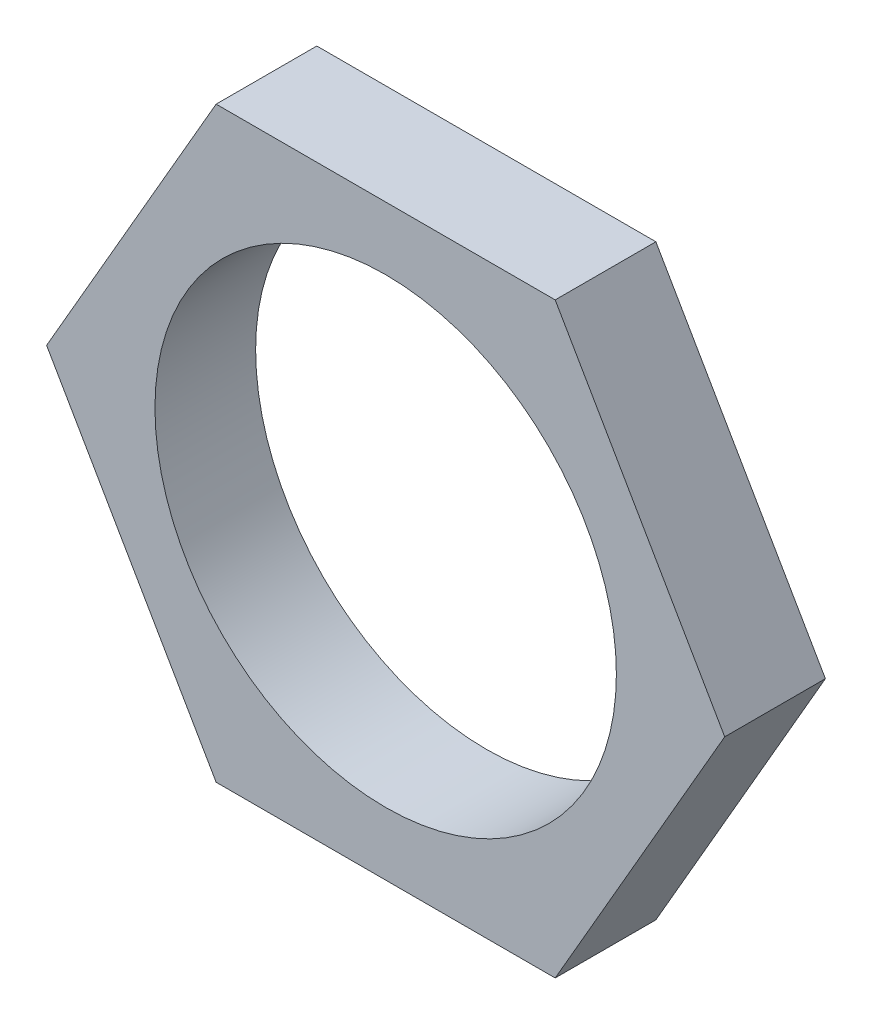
from build123d import *

# Parameters (mm, degrees)
SKICA1_R        = 5.5
VYSUNOUT1_DEPTH = 2.4


with BuildPart() as part:
    # Skica1 → Vysunout1 (new body)
    with BuildSketch(Plane.XY):
        Polygon((-8.082903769, 0), (-4.041451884, -7), (4.041451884, -7), (8.082903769, 0), (4.041451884, 7), (-4.041451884, 7), align=None)
        Circle(SKICA1_R, mode=Mode.SUBTRACT)
    extrude(amount=VYSUNOUT1_DEPTH)


solid = part.part
